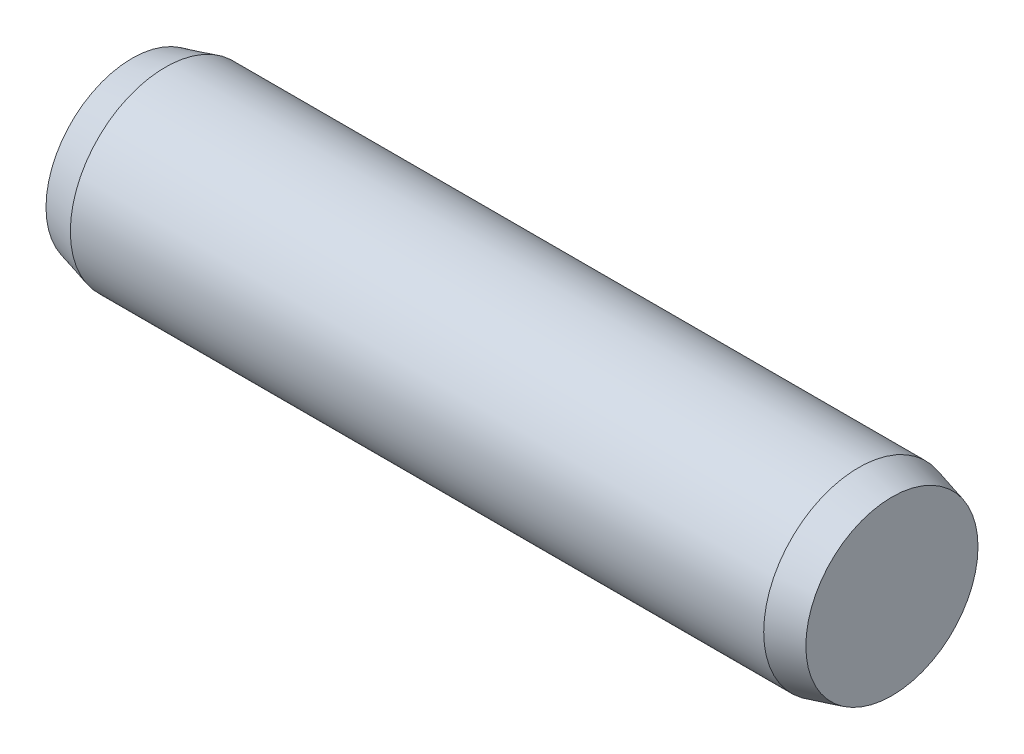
ISO-10303-21;
HEADER;
FILE_DESCRIPTION(('STEP AP214'),'2;1');
FILE_NAME('part.step','',(''),(''),'','','');
FILE_SCHEMA(('AUTOMOTIVE_DESIGN { 1 0 10303 214 1 1 1 1 }'));
ENDSEC;
DATA;
#1=APPLICATION_CONTEXT('core data for automotive mechanical design processes');
#2=APPLICATION_PROTOCOL_DEFINITION('international standard','automotive_design',2000,#1);
#3=PRODUCT_CONTEXT('',#1,'mechanical');
#4=PRODUCT('Part','Part','',(#3));
#5=PRODUCT_RELATED_PRODUCT_CATEGORY('part','',(#4));
#6=PRODUCT_DEFINITION_FORMATION('','',#4);
#7=PRODUCT_DEFINITION_CONTEXT('part definition',#1,'design');
#8=PRODUCT_DEFINITION('design','',#6,#7);
#9=PRODUCT_DEFINITION_SHAPE('','',#8);
#10=(LENGTH_UNIT() NAMED_UNIT(*) SI_UNIT(.MILLI.,.METRE.));
#11=(NAMED_UNIT(*) PLANE_ANGLE_UNIT() SI_UNIT($,.RADIAN.));
#12=(NAMED_UNIT(*) SI_UNIT($,.STERADIAN.) SOLID_ANGLE_UNIT());
#13=UNCERTAINTY_MEASURE_WITH_UNIT(LENGTH_MEASURE(1.E-05),#10,'distance_accuracy_value','');
#14=(GEOMETRIC_REPRESENTATION_CONTEXT(3) GLOBAL_UNCERTAINTY_ASSIGNED_CONTEXT((#13)) GLOBAL_UNIT_ASSIGNED_CONTEXT((#10,
#11,#12)) REPRESENTATION_CONTEXT('',''));
#15=CARTESIAN_POINT('',(0.,0.,0.));
#16=DIRECTION('',(0.,0.,1.));
#17=DIRECTION('',(1.,0.,0.));
#18=AXIS2_PLACEMENT_3D('',#15,#16,#17);
#19=CARTESIAN_POINT('',(0.,0.906217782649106,0.));
#20=DIRECTION('',(1.,0.,0.));
#21=DIRECTION('',(0.,0.,-1.));
#22=AXIS2_PLACEMENT_3D('',#19,#20,#21);
#23=PLANE('',#22);
#24=CARTESIAN_POINT('',(0.,0.,0.));
#25=DIRECTION('',(-1.,0.,0.));
#26=DIRECTION('',(0.,0.,1.));
#27=AXIS2_PLACEMENT_3D('',#24,#25,#26);
#28=CIRCLE('',#27,0.906217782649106);
#29=CARTESIAN_POINT('',(0.,0.,0.906217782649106));
#30=VERTEX_POINT('',#29);
#31=EDGE_CURVE('E43',#30,#30,#28,.T.);
#32=ORIENTED_EDGE('',*,*,#31,.T.);
#33=EDGE_LOOP('',(#32));
#34=FACE_BOUND('',#33,.T.);
#35=ADVANCED_FACE('F29',(#34),#23,.F.);
#36=CARTESIAN_POINT('',(8.,0.,0.));
#37=DIRECTION('',(-1.,0.,0.));
#38=DIRECTION('',(0.,0.,1.));
#39=AXIS2_PLACEMENT_3D('',#36,#37,#38);
#40=PLANE('',#39);
#41=CARTESIAN_POINT('',(8.,0.,0.));
#42=DIRECTION('',(-1.,0.,0.));
#43=DIRECTION('',(0.,0.,1.));
#44=AXIS2_PLACEMENT_3D('',#41,#42,#43);
#45=CIRCLE('',#44,0.906217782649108);
#46=CARTESIAN_POINT('',(8.,0.,0.906217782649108));
#47=VERTEX_POINT('',#46);
#48=EDGE_CURVE('E10',#47,#47,#45,.T.);
#49=ORIENTED_EDGE('',*,*,#48,.F.);
#50=EDGE_LOOP('',(#49));
#51=FACE_BOUND('',#50,.T.);
#52=ADVANCED_FACE('F63',(#51),#40,.F.);
#53=CARTESIAN_POINT('',(8.,0.,0.));
#54=DIRECTION('',(-1.,0.,0.));
#55=DIRECTION('',(0.,0.,1.));
#56=AXIS2_PLACEMENT_3D('',#53,#54,#55);
#57=CONICAL_SURFACE('',#56,0.906217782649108,0.26179938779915);
#58=CARTESIAN_POINT('',(7.65,0.,0.));
#59=DIRECTION('',(-1.,0.,0.));
#60=DIRECTION('',(0.,0.,1.));
#61=AXIS2_PLACEMENT_3D('',#58,#59,#60);
#62=CIRCLE('',#61,1.);
#63=CARTESIAN_POINT('',(7.65,0.,1.));
#64=VERTEX_POINT('',#63);
#65=EDGE_CURVE('E35',#64,#64,#62,.T.);
#66=ORIENTED_EDGE('',*,*,#65,.F.);
#67=EDGE_LOOP('',(#66));
#68=FACE_BOUND('',#67,.T.);
#69=ORIENTED_EDGE('',*,*,#48,.T.);
#70=EDGE_LOOP('',(#69));
#71=FACE_BOUND('',#70,.T.);
#72=ADVANCED_FACE('F58',(#68,#71),#57,.T.);
#73=CARTESIAN_POINT('',(-6.35,0.,0.));
#74=DIRECTION('',(-1.,0.,0.));
#75=DIRECTION('',(0.,0.,1.));
#76=AXIS2_PLACEMENT_3D('',#73,#74,#75);
#77=CYLINDRICAL_SURFACE('',#76,0.999999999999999);
#78=CARTESIAN_POINT('',(0.35,0.,0.));
#79=DIRECTION('',(-1.,0.,0.));
#80=DIRECTION('',(0.,0.,1.));
#81=AXIS2_PLACEMENT_3D('',#78,#79,#80);
#82=CIRCLE('',#81,0.999999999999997);
#83=CARTESIAN_POINT('',(0.35,0.,0.999999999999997));
#84=VERTEX_POINT('',#83);
#85=EDGE_CURVE('E39',#84,#84,#82,.T.);
#86=ORIENTED_EDGE('',*,*,#85,.F.);
#87=EDGE_LOOP('',(#86));
#88=FACE_BOUND('',#87,.T.);
#89=ORIENTED_EDGE('',*,*,#65,.T.);
#90=EDGE_LOOP('',(#89));
#91=FACE_BOUND('',#90,.T.);
#92=ADVANCED_FACE('F53',(#88,#91),#77,.T.);
#93=CARTESIAN_POINT('',(0.35,0.,0.));
#94=DIRECTION('',(1.,0.,0.));
#95=DIRECTION('',(0.,0.,-1.));
#96=AXIS2_PLACEMENT_3D('',#93,#94,#95);
#97=CONICAL_SURFACE('',#96,0.999999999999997,0.261799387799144);
#98=ORIENTED_EDGE('',*,*,#31,.F.);
#99=EDGE_LOOP('',(#98));
#100=FACE_BOUND('',#99,.T.);
#101=ORIENTED_EDGE('',*,*,#85,.T.);
#102=EDGE_LOOP('',(#101));
#103=FACE_BOUND('',#102,.T.);
#104=ADVANCED_FACE('F50',(#100,#103),#97,.T.);
#105=CLOSED_SHELL('',(#35,#52,#72,#92,#104));
#106=MANIFOLD_SOLID_BREP('B2',#105);
#107=ADVANCED_BREP_SHAPE_REPRESENTATION('',(#18,#106),#14);
#108=SHAPE_DEFINITION_REPRESENTATION(#9,#107);
ENDSEC;
END-ISO-10303-21;
